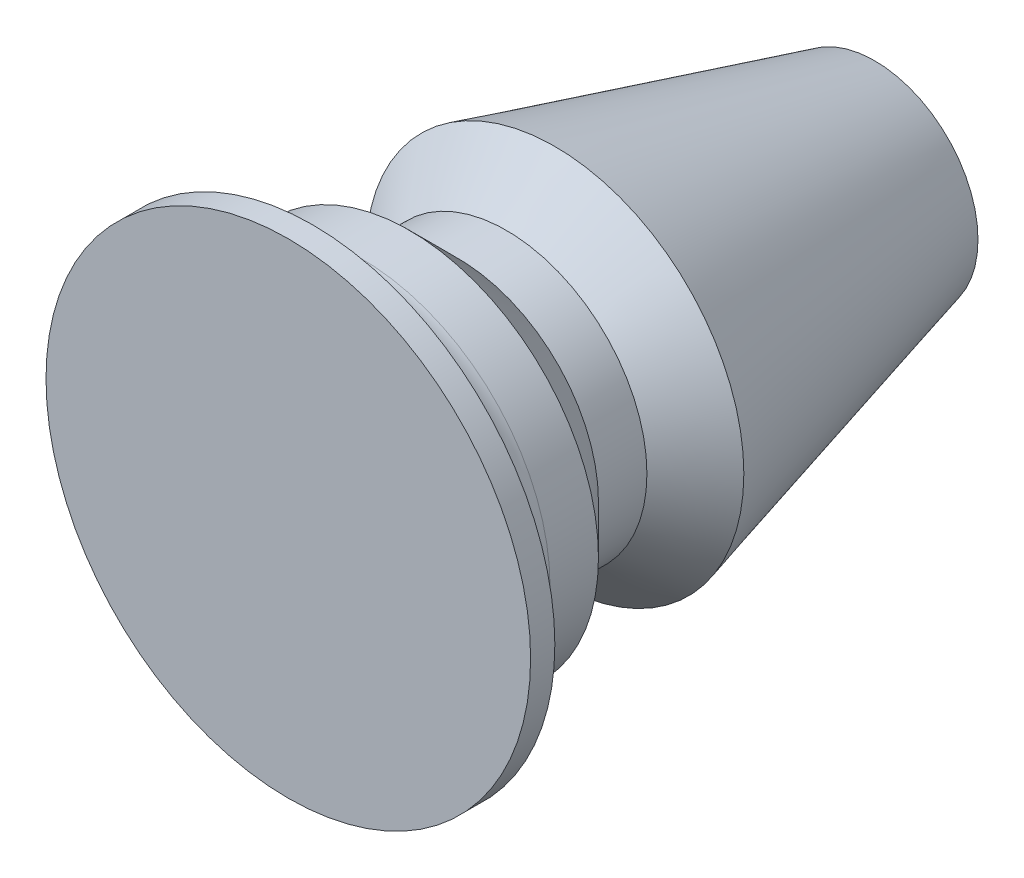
ISO-10303-21;
HEADER;
FILE_DESCRIPTION(('STEP AP214'),'2;1');
FILE_NAME('part.step','',(''),(''),'','','');
FILE_SCHEMA(('AUTOMOTIVE_DESIGN { 1 0 10303 214 1 1 1 1 }'));
ENDSEC;
DATA;
#1=APPLICATION_CONTEXT('core data for automotive mechanical design processes');
#2=APPLICATION_PROTOCOL_DEFINITION('international standard','automotive_design',2000,#1);
#3=PRODUCT_CONTEXT('',#1,'mechanical');
#4=PRODUCT('Part','Part','',(#3));
#5=PRODUCT_RELATED_PRODUCT_CATEGORY('part','',(#4));
#6=PRODUCT_DEFINITION_FORMATION('','',#4);
#7=PRODUCT_DEFINITION_CONTEXT('part definition',#1,'design');
#8=PRODUCT_DEFINITION('design','',#6,#7);
#9=PRODUCT_DEFINITION_SHAPE('','',#8);
#10=(LENGTH_UNIT() NAMED_UNIT(*) SI_UNIT(.MILLI.,.METRE.));
#11=(NAMED_UNIT(*) PLANE_ANGLE_UNIT() SI_UNIT($,.RADIAN.));
#12=(NAMED_UNIT(*) SI_UNIT($,.STERADIAN.) SOLID_ANGLE_UNIT());
#13=UNCERTAINTY_MEASURE_WITH_UNIT(LENGTH_MEASURE(1.E-05),#10,'distance_accuracy_value','');
#14=(GEOMETRIC_REPRESENTATION_CONTEXT(3) GLOBAL_UNCERTAINTY_ASSIGNED_CONTEXT((#13)) GLOBAL_UNIT_ASSIGNED_CONTEXT((#10,
#11,#12)) REPRESENTATION_CONTEXT('',''));
#15=CARTESIAN_POINT('',(0.,0.,0.));
#16=DIRECTION('',(0.,0.,1.));
#17=DIRECTION('',(1.,0.,0.));
#18=AXIS2_PLACEMENT_3D('',#15,#16,#17);
#19=CARTESIAN_POINT('',(0.,0.,-5.));
#20=DIRECTION('',(0.,0.,1.));
#21=DIRECTION('',(1.,0.,0.));
#22=AXIS2_PLACEMENT_3D('',#19,#20,#21);
#23=CYLINDRICAL_SURFACE('',#22,2.9);
#24=CARTESIAN_POINT('',(0.,0.,-3.00000000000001));
#25=DIRECTION('',(0.,0.,1.));
#26=DIRECTION('',(1.,0.,0.));
#27=AXIS2_PLACEMENT_3D('',#24,#25,#26);
#28=CIRCLE('',#27,2.9);
#29=CARTESIAN_POINT('',(2.9,0.,-3.00000000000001));
#30=VERTEX_POINT('',#29);
#31=EDGE_CURVE('E44',#30,#30,#28,.F.);
#32=ORIENTED_EDGE('',*,*,#31,.T.);
#33=EDGE_LOOP('',(#32));
#34=FACE_BOUND('',#33,.T.);
#35=CARTESIAN_POINT('',(0.,0.,-3.99999999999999));
#36=DIRECTION('',(0.,0.,1.));
#37=DIRECTION('',(1.,0.,0.));
#38=AXIS2_PLACEMENT_3D('',#35,#36,#37);
#39=CIRCLE('',#38,2.9);
#40=CARTESIAN_POINT('',(2.9,0.,-3.99999999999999));
#41=VERTEX_POINT('',#40);
#42=EDGE_CURVE('E48',#41,#41,#39,.T.);
#43=ORIENTED_EDGE('',*,*,#42,.T.);
#44=EDGE_LOOP('',(#43));
#45=FACE_BOUND('',#44,.T.);
#46=ADVANCED_FACE('F33',(#34,#45),#23,.T.);
#47=CARTESIAN_POINT('',(0.,0.,-11.6));
#48=DIRECTION('',(0.,0.,1.));
#49=DIRECTION('',(1.,0.,0.));
#50=AXIS2_PLACEMENT_3D('',#47,#48,#49);
#51=PLANE('',#50);
#52=CARTESIAN_POINT('',(0.,0.,-11.6));
#53=DIRECTION('',(0.,0.,1.));
#54=DIRECTION('',(1.,0.,0.));
#55=AXIS2_PLACEMENT_3D('',#52,#53,#54);
#56=CIRCLE('',#55,2.13153532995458);
#57=CARTESIAN_POINT('',(2.13153532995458,0.,-11.6));
#58=VERTEX_POINT('',#57);
#59=EDGE_CURVE('E53',#58,#58,#56,.F.);
#60=ORIENTED_EDGE('',*,*,#59,.T.);
#61=EDGE_LOOP('',(#60));
#62=FACE_BOUND('',#61,.T.);
#63=ADVANCED_FACE('F80',(#62),#51,.F.);
#64=CARTESIAN_POINT('',(0.,0.,-4.9999999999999));
#65=DIRECTION('',(0.,0.,1.));
#66=DIRECTION('',(1.,0.,0.));
#67=AXIS2_PLACEMENT_3D('',#64,#65,#66);
#68=CONICAL_SURFACE('',#67,3.9,0.261799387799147);
#69=CARTESIAN_POINT('',(0.,0.,-5.));
#70=DIRECTION('',(0.,0.,1.));
#71=DIRECTION('',(1.,0.,0.));
#72=AXIS2_PLACEMENT_3D('',#69,#70,#71);
#73=CIRCLE('',#72,3.9);
#74=CARTESIAN_POINT('',(3.89999999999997,0.,-5.));
#75=VERTEX_POINT('',#74);
#76=EDGE_CURVE('E56',#75,#75,#73,.T.);
#77=CARTESIAN_POINT('',(2.13153532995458,0.,-11.6));
#78=CARTESIAN_POINT('',(2.14995683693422,0.,-11.53125));
#79=CARTESIAN_POINT('',(2.16837834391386,0.,-11.4625));
#80=CARTESIAN_POINT('',(2.20522135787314,0.,-11.325));
#81=CARTESIAN_POINT('',(2.22364286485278,0.,-11.25625));
#82=CARTESIAN_POINT('',(2.26048587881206,0.,-11.11875));
#83=CARTESIAN_POINT('',(2.2789073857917,0.,-11.05));
#84=CARTESIAN_POINT('',(2.31575039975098,0.,-10.9125));
#85=CARTESIAN_POINT('',(2.33417190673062,0.,-10.84375));
#86=CARTESIAN_POINT('',(2.3710149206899,0.,-10.70625));
#87=CARTESIAN_POINT('',(2.38943642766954,0.,-10.6375));
#88=CARTESIAN_POINT('',(2.42627944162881,0.,-10.5));
#89=CARTESIAN_POINT('',(2.44470094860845,0.,-10.43125));
#90=CARTESIAN_POINT('',(2.48154396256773,0.,-10.29375));
#91=CARTESIAN_POINT('',(2.49996546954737,0.,-10.225));
#92=CARTESIAN_POINT('',(2.53680848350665,0.,-10.0875));
#93=CARTESIAN_POINT('',(2.55522999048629,0.,-10.01875));
#94=CARTESIAN_POINT('',(2.59207300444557,0.,-9.88125));
#95=CARTESIAN_POINT('',(2.61049451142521,0.,-9.8125));
#96=CARTESIAN_POINT('',(2.64733752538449,0.,-9.675));
#97=CARTESIAN_POINT('',(2.66575903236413,0.,-9.60625));
#98=CARTESIAN_POINT('',(2.70260204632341,0.,-9.46875));
#99=CARTESIAN_POINT('',(2.72102355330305,0.,-9.4));
#100=CARTESIAN_POINT('',(2.75786656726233,0.,-9.2625));
#101=CARTESIAN_POINT('',(2.77628807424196,0.,-9.19375));
#102=CARTESIAN_POINT('',(2.81313108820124,0.,-9.05625));
#103=CARTESIAN_POINT('',(2.83155259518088,0.,-8.9875));
#104=CARTESIAN_POINT('',(2.86839560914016,0.,-8.85));
#105=CARTESIAN_POINT('',(2.8868171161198,0.,-8.78125));
#106=CARTESIAN_POINT('',(2.92366013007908,0.,-8.64375));
#107=CARTESIAN_POINT('',(2.94208163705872,0.,-8.575));
#108=CARTESIAN_POINT('',(2.978924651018,0.,-8.4375));
#109=CARTESIAN_POINT('',(2.99734615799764,0.,-8.36875));
#110=CARTESIAN_POINT('',(3.03418917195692,0.,-8.23125));
#111=CARTESIAN_POINT('',(3.05261067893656,0.,-8.1625));
#112=CARTESIAN_POINT('',(3.08945369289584,0.,-8.025));
#113=CARTESIAN_POINT('',(3.10787519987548,0.,-7.95625));
#114=CARTESIAN_POINT('',(3.14471821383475,0.,-7.81875));
#115=CARTESIAN_POINT('',(3.16313972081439,0.,-7.75));
#116=CARTESIAN_POINT('',(3.19998273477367,0.,-7.6125));
#117=CARTESIAN_POINT('',(3.21840424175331,0.,-7.54375));
#118=CARTESIAN_POINT('',(3.25524725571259,0.,-7.40625));
#119=CARTESIAN_POINT('',(3.27366876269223,0.,-7.3375));
#120=CARTESIAN_POINT('',(3.31051177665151,0.,-7.2));
#121=CARTESIAN_POINT('',(3.32893328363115,0.,-7.13125));
#122=CARTESIAN_POINT('',(3.36577629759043,0.,-6.99375));
#123=CARTESIAN_POINT('',(3.38419780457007,0.,-6.925));
#124=CARTESIAN_POINT('',(3.42104081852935,0.,-6.7875));
#125=CARTESIAN_POINT('',(3.43946232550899,0.,-6.71875));
#126=CARTESIAN_POINT('',(3.47630533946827,0.,-6.58125));
#127=CARTESIAN_POINT('',(3.49472684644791,0.,-6.5125));
#128=CARTESIAN_POINT('',(3.53156986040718,0.,-6.375));
#129=CARTESIAN_POINT('',(3.54999136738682,0.,-6.30625));
#130=CARTESIAN_POINT('',(3.5868343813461,0.,-6.16875));
#131=CARTESIAN_POINT('',(3.60525588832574,0.,-6.1));
#132=CARTESIAN_POINT('',(3.64209890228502,0.,-5.9625));
#133=CARTESIAN_POINT('',(3.66052040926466,0.,-5.89375));
#134=CARTESIAN_POINT('',(3.69736342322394,0.,-5.75625));
#135=CARTESIAN_POINT('',(3.71578493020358,0.,-5.6875));
#136=CARTESIAN_POINT('',(3.75262794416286,0.,-5.55));
#137=CARTESIAN_POINT('',(3.7710494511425,0.,-5.48125));
#138=CARTESIAN_POINT('',(3.80789246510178,0.,-5.34375));
#139=CARTESIAN_POINT('',(3.82631397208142,0.,-5.275));
#140=CARTESIAN_POINT('',(3.86315698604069,0.,-5.1375));
#141=CARTESIAN_POINT('',(3.88157849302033,0.,-5.06875));
#142=CARTESIAN_POINT('',(3.89999999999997,0.,-5.));
#143=B_SPLINE_CURVE_WITH_KNOTS('',3,(#77,#78,#79,#80,#81,#82,#83,#84,#85,#86,#87,#88,#89,#90,
#91,#92,#93,#94,#95,#96,#97,#98,#99,#100,#101,#102,#103,#104,#105,#106,#107,#108,#109,#110,#111,
#112,#113,#114,#115,#116,#117,#118,#119,#120,#121,#122,#123,#124,#125,#126,#127,#128,#129,#130,
#131,#132,#133,#134,#135,#136,#137,#138,#139,#140,#141,#142),.UNSPECIFIED.,.F.,.F.,(4,2,2,2,2,2,
2,2,2,2,2,2,2,2,2,2,2,2,2,2,2,2,2,2,2,2,2,2,2,2,2,2,4),(0.,0.213525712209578,0.427051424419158,
0.640577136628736,0.854102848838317,1.0676285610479,1.28115427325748,1.49467998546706,
1.70820569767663,1.92173140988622,2.13525712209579,2.34878283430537,2.56230854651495,
2.77583425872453,2.98935997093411,3.20288568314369,3.41641139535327,3.62993710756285,
3.84346281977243,4.05698853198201,4.27051424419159,4.48403995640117,4.69756566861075,
4.91109138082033,5.12461709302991,5.33814280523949,5.55166851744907,5.76519422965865,
5.97871994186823,6.19224565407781,6.40577136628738,6.61929707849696,6.83282279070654),.UNSPECIFIED.);
#144=EDGE_CURVE('BSEAM91',#58,#75,#143,.T.);
#145=ORIENTED_EDGE('',*,*,#59,.F.);
#146=ORIENTED_EDGE('',*,*,#76,.F.);
#147=ORIENTED_EDGE('',*,*,#144,.T.);
#148=ORIENTED_EDGE('',*,*,#144,.F.);
#149=EDGE_LOOP('',(#145,#147,#146,#148));
#150=FACE_BOUND('',#149,.T.);
#151=ADVANCED_FACE('F91',(#150),#68,.T.);
#152=CARTESIAN_POINT('',(0.,0.,0.5));
#153=DIRECTION('',(0.,0.,-1.));
#154=DIRECTION('',(-1.,0.,0.));
#155=AXIS2_PLACEMENT_3D('',#152,#153,#154);
#156=CYLINDRICAL_SURFACE('',#155,5.);
#157=CARTESIAN_POINT('',(0.,0.,0.5));
#158=DIRECTION('',(0.,0.,1.));
#159=DIRECTION('',(1.,0.,0.));
#160=AXIS2_PLACEMENT_3D('',#157,#158,#159);
#161=CIRCLE('',#160,5.);
#162=CARTESIAN_POINT('',(5.,0.,0.5));
#163=VERTEX_POINT('',#162);
#164=EDGE_CURVE('E59',#163,#163,#161,.T.);
#165=ORIENTED_EDGE('',*,*,#164,.F.);
#166=EDGE_LOOP('',(#165));
#167=FACE_BOUND('',#166,.T.);
#168=CARTESIAN_POINT('',(0.,0.,0.));
#169=DIRECTION('',(0.,0.,1.));
#170=DIRECTION('',(1.,0.,0.));
#171=AXIS2_PLACEMENT_3D('',#168,#169,#170);
#172=CIRCLE('',#171,5.);
#173=CARTESIAN_POINT('',(5.,0.,0.));
#174=VERTEX_POINT('',#173);
#175=EDGE_CURVE('E60',#174,#174,#172,.T.);
#176=ORIENTED_EDGE('',*,*,#175,.T.);
#177=EDGE_LOOP('',(#176));
#178=FACE_BOUND('',#177,.T.);
#179=ADVANCED_FACE('F94',(#167,#178),#156,.T.);
#180=CARTESIAN_POINT('',(0.,0.,0.5));
#181=DIRECTION('',(0.,0.,1.));
#182=DIRECTION('',(1.,0.,0.));
#183=AXIS2_PLACEMENT_3D('',#180,#181,#182);
#184=PLANE('',#183);
#185=ORIENTED_EDGE('',*,*,#164,.T.);
#186=EDGE_LOOP('',(#185));
#187=FACE_BOUND('',#186,.T.);
#188=ADVANCED_FACE('F101',(#187),#184,.T.);
#189=CARTESIAN_POINT('',(0.,0.,0.));
#190=DIRECTION('',(0.,0.,1.));
#191=DIRECTION('',(1.,0.,0.));
#192=AXIS2_PLACEMENT_3D('',#189,#190,#191);
#193=PLANE('',#192);
#194=CARTESIAN_POINT('',(0.,0.,0.));
#195=DIRECTION('',(0.,0.,1.));
#196=DIRECTION('',(1.,0.,0.));
#197=AXIS2_PLACEMENT_3D('',#194,#195,#196);
#198=CIRCLE('',#197,4.9);
#199=CARTESIAN_POINT('',(4.9,0.,0.));
#200=VERTEX_POINT('',#199);
#201=EDGE_CURVE('E40',#200,#200,#198,.T.);
#202=ORIENTED_EDGE('',*,*,#201,.T.);
#203=EDGE_LOOP('',(#202));
#204=FACE_BOUND('',#203,.T.);
#205=ORIENTED_EDGE('',*,*,#175,.F.);
#206=EDGE_LOOP('',(#205));
#207=FACE_BOUND('',#206,.T.);
#208=ADVANCED_FACE('F103',(#204,#207),#193,.F.);
#209=CARTESIAN_POINT('',(0.,0.,-2.));
#210=DIRECTION('',(0.,0.,1.));
#211=DIRECTION('',(1.,0.,0.));
#212=AXIS2_PLACEMENT_3D('',#209,#210,#211);
#213=CYLINDRICAL_SURFACE('',#212,3.9);
#214=CARTESIAN_POINT('',(0.,0.,-1.));
#215=DIRECTION('',(0.,0.,1.));
#216=DIRECTION('',(1.,0.,0.));
#217=AXIS2_PLACEMENT_3D('',#214,#215,#216);
#218=CIRCLE('',#217,3.9);
#219=CARTESIAN_POINT('',(3.9,0.,-1.));
#220=VERTEX_POINT('',#219);
#221=EDGE_CURVE('E10',#220,#220,#218,.F.);
#222=ORIENTED_EDGE('',*,*,#221,.T.);
#223=EDGE_LOOP('',(#222));
#224=FACE_BOUND('',#223,.T.);
#225=CARTESIAN_POINT('',(0.,0.,-2.));
#226=DIRECTION('',(0.,0.,1.));
#227=DIRECTION('',(1.,0.,0.));
#228=AXIS2_PLACEMENT_3D('',#225,#226,#227);
#229=CIRCLE('',#228,3.9);
#230=CARTESIAN_POINT('',(3.9,0.,-2.));
#231=VERTEX_POINT('',#230);
#232=EDGE_CURVE('E63',#231,#231,#229,.T.);
#233=ORIENTED_EDGE('',*,*,#232,.T.);
#234=EDGE_LOOP('',(#233));
#235=FACE_BOUND('',#234,.T.);
#236=ADVANCED_FACE('F69',(#224,#235),#213,.T.);
#237=CARTESIAN_POINT('',(0.,0.,-3.00000000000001));
#238=DIRECTION('',(0.,0.,1.));
#239=DIRECTION('',(1.,0.,0.));
#240=AXIS2_PLACEMENT_3D('',#237,#238,#239);
#241=CONICAL_SURFACE('',#240,2.9,0.785398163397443);
#242=ORIENTED_EDGE('',*,*,#232,.F.);
#243=EDGE_LOOP('',(#242));
#244=FACE_BOUND('',#243,.T.);
#245=ORIENTED_EDGE('',*,*,#31,.F.);
#246=EDGE_LOOP('',(#245));
#247=FACE_BOUND('',#246,.T.);
#248=ADVANCED_FACE('F71',(#244,#247),#241,.T.);
#249=CARTESIAN_POINT('',(0.,0.,-3.99999999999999));
#250=DIRECTION('',(0.,0.,-1.));
#251=DIRECTION('',(-1.,0.,0.));
#252=AXIS2_PLACEMENT_3D('',#249,#250,#251);
#253=CONICAL_SURFACE('',#252,2.9,0.785398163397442);
#254=ORIENTED_EDGE('',*,*,#76,.T.);
#255=EDGE_LOOP('',(#254));
#256=FACE_BOUND('',#255,.T.);
#257=ORIENTED_EDGE('',*,*,#42,.F.);
#258=EDGE_LOOP('',(#257));
#259=FACE_BOUND('',#258,.T.);
#260=ADVANCED_FACE('F74',(#256,#259),#253,.T.);
#261=CARTESIAN_POINT('',(0.,0.,-1.));
#262=DIRECTION('',(0.,0.,1.));
#263=DIRECTION('',(1.,0.,0.));
#264=AXIS2_PLACEMENT_3D('',#261,#262,#263);
#265=TOROIDAL_SURFACE('',#264,4.9,1.);
#266=ORIENTED_EDGE('',*,*,#221,.F.);
#267=EDGE_LOOP('',(#266));
#268=FACE_BOUND('',#267,.T.);
#269=ORIENTED_EDGE('',*,*,#201,.F.);
#270=EDGE_LOOP('',(#269));
#271=FACE_BOUND('',#270,.T.);
#272=ADVANCED_FACE('F35',(#268,#271),#265,.F.);
#273=CLOSED_SHELL('',(#46,#63,#151,#179,#188,#208,#236,#248,#260,#272));
#274=MANIFOLD_SOLID_BREP('B2',#273);
#275=ADVANCED_BREP_SHAPE_REPRESENTATION('',(#18,#274),#14);
#276=SHAPE_DEFINITION_REPRESENTATION(#9,#275);
ENDSEC;
END-ISO-10303-21;
